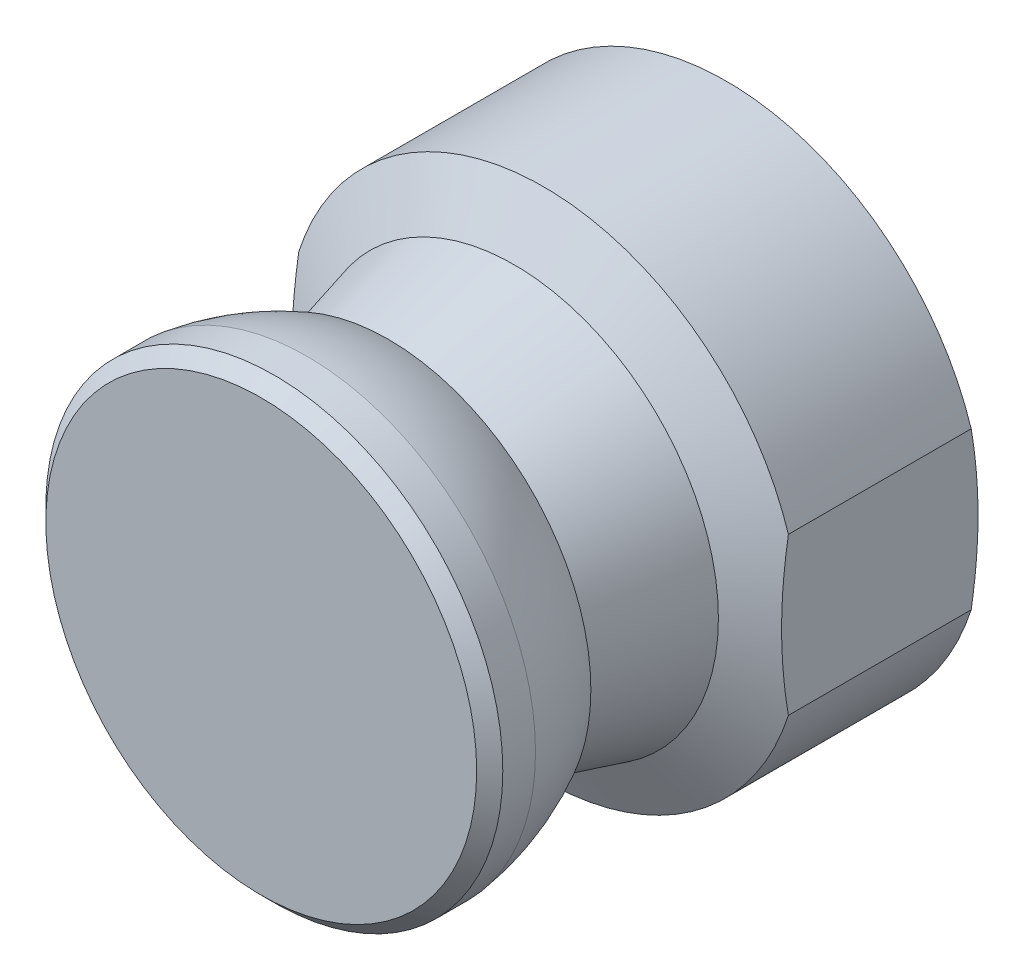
ISO-10303-21;
HEADER;
FILE_DESCRIPTION(('STEP AP214'),'2;1');
FILE_NAME('part.step','',(''),(''),'','','');
FILE_SCHEMA(('AUTOMOTIVE_DESIGN { 1 0 10303 214 1 1 1 1 }'));
ENDSEC;
DATA;
#1=APPLICATION_CONTEXT('core data for automotive mechanical design processes');
#2=APPLICATION_PROTOCOL_DEFINITION('international standard','automotive_design',2000,#1);
#3=PRODUCT_CONTEXT('',#1,'mechanical');
#4=PRODUCT('Part','Part','',(#3));
#5=PRODUCT_RELATED_PRODUCT_CATEGORY('part','',(#4));
#6=PRODUCT_DEFINITION_FORMATION('','',#4);
#7=PRODUCT_DEFINITION_CONTEXT('part definition',#1,'design');
#8=PRODUCT_DEFINITION('design','',#6,#7);
#9=PRODUCT_DEFINITION_SHAPE('','',#8);
#10=(LENGTH_UNIT() NAMED_UNIT(*) SI_UNIT(.MILLI.,.METRE.));
#11=(NAMED_UNIT(*) PLANE_ANGLE_UNIT() SI_UNIT($,.RADIAN.));
#12=(NAMED_UNIT(*) SI_UNIT($,.STERADIAN.) SOLID_ANGLE_UNIT());
#13=UNCERTAINTY_MEASURE_WITH_UNIT(LENGTH_MEASURE(1.E-05),#10,'distance_accuracy_value','');
#14=(GEOMETRIC_REPRESENTATION_CONTEXT(3) GLOBAL_UNCERTAINTY_ASSIGNED_CONTEXT((#13)) GLOBAL_UNIT_ASSIGNED_CONTEXT((#10,
#11,#12)) REPRESENTATION_CONTEXT('',''));
#15=CARTESIAN_POINT('',(0.,0.,0.));
#16=DIRECTION('',(0.,0.,1.));
#17=DIRECTION('',(1.,0.,0.));
#18=AXIS2_PLACEMENT_3D('',#15,#16,#17);
#19=CARTESIAN_POINT('',(0.,0.,29.));
#20=DIRECTION('',(0.,0.,1.));
#21=DIRECTION('',(1.,0.,0.));
#22=AXIS2_PLACEMENT_3D('',#19,#20,#21);
#23=CYLINDRICAL_SURFACE('',#22,15.75);
#24=DIRECTION('',(0.,0.,1.));
#25=VECTOR('',#24,1.);
#26=CARTESIAN_POINT('',(-15.,4.80234317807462,29.));
#27=LINE('',#26,#25);
#28=CARTESIAN_POINT('',(-15.,4.80234317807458,11.7));
#29=VERTEX_POINT('',#28);
#30=CARTESIAN_POINT('',(-15.,4.80234317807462,0.499999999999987));
#31=VERTEX_POINT('',#30);
#32=EDGE_CURVE('E60',#29,#31,#27,.F.);
#33=ORIENTED_EDGE('',*,*,#32,.F.);
#34=CARTESIAN_POINT('',(0.,0.,11.7));
#35=DIRECTION('',(0.,0.,1.));
#36=DIRECTION('',(1.,0.,0.));
#37=AXIS2_PLACEMENT_3D('',#34,#35,#36);
#38=CIRCLE('',#37,15.75);
#39=CARTESIAN_POINT('',(15.,4.80234317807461,11.7));
#40=VERTEX_POINT('',#39);
#41=EDGE_CURVE('E68',#40,#29,#38,.T.);
#42=ORIENTED_EDGE('',*,*,#41,.F.);
#43=DIRECTION('',(0.,0.,1.));
#44=VECTOR('',#43,1.);
#45=CARTESIAN_POINT('',(15.,4.80234317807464,29.));
#46=LINE('',#45,#44);
#47=CARTESIAN_POINT('',(15.,4.80234317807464,0.499999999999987));
#48=VERTEX_POINT('',#47);
#49=EDGE_CURVE('E42',#48,#40,#46,.T.);
#50=ORIENTED_EDGE('',*,*,#49,.F.);
#51=CARTESIAN_POINT('',(0.,0.,0.500000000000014));
#52=DIRECTION('',(0.,0.,1.));
#53=DIRECTION('',(1.,0.,0.));
#54=AXIS2_PLACEMENT_3D('',#51,#52,#53);
#55=CIRCLE('',#54,15.75);
#56=EDGE_CURVE('E70',#48,#31,#55,.T.);
#57=ORIENTED_EDGE('',*,*,#56,.T.);
#58=EDGE_LOOP('',(#33,#42,#50,#57));
#59=FACE_BOUND('',#58,.T.);
#60=ADVANCED_FACE('F14',(#59),#23,.T.);
#61=CARTESIAN_POINT('',(0.,0.,29.));
#62=DIRECTION('',(0.,0.,1.));
#63=DIRECTION('',(1.,0.,0.));
#64=AXIS2_PLACEMENT_3D('',#61,#62,#63);
#65=CYLINDRICAL_SURFACE('',#64,10.);
#66=CARTESIAN_POINT('',(0.,0.,13.5));
#67=DIRECTION('',(0.,0.,1.));
#68=DIRECTION('',(1.,0.,0.));
#69=AXIS2_PLACEMENT_3D('',#66,#67,#68);
#70=CIRCLE('',#69,10.);
#71=CARTESIAN_POINT('',(10.,0.,13.5));
#72=VERTEX_POINT('',#71);
#73=EDGE_CURVE('E148',#72,#72,#70,.T.);
#74=ORIENTED_EDGE('',*,*,#73,.T.);
#75=EDGE_LOOP('',(#74));
#76=FACE_BOUND('',#75,.T.);
#77=CARTESIAN_POINT('',(0.,0.,0.));
#78=DIRECTION('',(0.,0.,1.));
#79=DIRECTION('',(1.,0.,0.));
#80=AXIS2_PLACEMENT_3D('',#77,#78,#79);
#81=CIRCLE('',#80,10.);
#82=CARTESIAN_POINT('',(10.,0.,0.));
#83=VERTEX_POINT('',#82);
#84=EDGE_CURVE('E86',#83,#83,#81,.T.);
#85=ORIENTED_EDGE('',*,*,#84,.F.);
#86=EDGE_LOOP('',(#85));
#87=FACE_BOUND('',#86,.T.);
#88=ADVANCED_FACE('F16',(#76,#87),#65,.F.);
#89=CARTESIAN_POINT('',(10.,0.,0.));
#90=DIRECTION('',(0.,0.,-1.));
#91=DIRECTION('',(-1.,0.,0.));
#92=AXIS2_PLACEMENT_3D('',#89,#90,#91);
#93=PLANE('',#92);
#94=ORIENTED_EDGE('',*,*,#84,.T.);
#95=EDGE_LOOP('',(#94));
#96=FACE_BOUND('',#95,.T.);
#97=CARTESIAN_POINT('',(0.,0.,0.));
#98=DIRECTION('',(0.,0.,1.));
#99=DIRECTION('',(1.,0.,0.));
#100=AXIS2_PLACEMENT_3D('',#97,#98,#99);
#101=CIRCLE('',#100,14.85);
#102=CARTESIAN_POINT('',(14.85,0.,0.));
#103=VERTEX_POINT('',#102);
#104=EDGE_CURVE('E83',#103,#103,#101,.T.);
#105=ORIENTED_EDGE('',*,*,#104,.F.);
#106=EDGE_LOOP('',(#105));
#107=FACE_BOUND('',#106,.T.);
#108=ADVANCED_FACE('F110',(#96,#107),#93,.T.);
#109=CARTESIAN_POINT('',(0.,0.,0.500000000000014));
#110=DIRECTION('',(0.,0.,1.));
#111=DIRECTION('',(1.,0.,0.));
#112=AXIS2_PLACEMENT_3D('',#109,#110,#111);
#113=CONICAL_SURFACE('',#112,15.75,1.06369782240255);
#114=CARTESIAN_POINT('',(-15.,-17.649830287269,4.61823667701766));
#115=CARTESIAN_POINT('',(-15.,-17.3722406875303,4.50072848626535));
#116=CARTESIAN_POINT('',(-15.,-17.0942364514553,4.38420065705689));
#117=CARTESIAN_POINT('',(-15.,-16.537323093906,4.15331315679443));
#118=CARTESIAN_POINT('',(-15.,-16.2584139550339,4.03895352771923));
#119=CARTESIAN_POINT('',(-15.,-15.4200966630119,3.69939009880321));
#120=CARTESIAN_POINT('',(-15.,-14.8592329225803,3.47775883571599));
#121=CARTESIAN_POINT('',(-15.,-13.729824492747,3.04486958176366));
#122=CARTESIAN_POINT('',(-15.,-13.1612542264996,2.83367809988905));
#123=CARTESIAN_POINT('',(-15.,-12.0189847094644,2.42569928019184));
#124=CARTESIAN_POINT('',(-15.,-11.445285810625,2.22891096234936));
#125=CARTESIAN_POINT('',(-15.,-10.3011217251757,1.85594943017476));
#126=CARTESIAN_POINT('',(-15.,-9.73074660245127,1.67950163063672));
#127=CARTESIAN_POINT('',(-15.,-8.58385438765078,1.34750253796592));
#128=CARTESIAN_POINT('',(-15.,-8.00733691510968,1.19195254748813));
#129=CARTESIAN_POINT('',(-15.,-6.84925678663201,0.906454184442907));
#130=CARTESIAN_POINT('',(-15.,-6.26770765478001,0.776451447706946));
#131=CARTESIAN_POINT('',(-15.,-5.0987344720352,0.546373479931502));
#132=CARTESIAN_POINT('',(-15.,-4.51131171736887,0.44629179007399));
#133=CARTESIAN_POINT('',(-15.,-3.57558288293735,0.314797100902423));
#134=CARTESIAN_POINT('',(-15.,-3.22884186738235,0.272101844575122));
#135=CARTESIAN_POINT('',(-15.,-2.53404964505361,0.199287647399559));
#136=CARTESIAN_POINT('',(-15.,-2.18599852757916,0.169167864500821));
#137=CARTESIAN_POINT('',(-15.,-1.4889343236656,0.122080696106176));
#138=CARTESIAN_POINT('',(-15.,-1.1399210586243,0.105115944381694));
#139=CARTESIAN_POINT('',(-15.,-0.441493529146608,0.0846908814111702));
#140=CARTESIAN_POINT('',(-15.,-0.0920792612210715,0.0812306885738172));
#141=CARTESIAN_POINT('',(-15.,0.607727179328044,0.0878977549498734));
#142=CARTESIAN_POINT('',(-15.,0.958118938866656,0.0980681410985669));
#143=CARTESIAN_POINT('',(-15.,1.65824729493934,0.131861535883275));
#144=CARTESIAN_POINT('',(-15.,2.00798389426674,0.155484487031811));
#145=CARTESIAN_POINT('',(-15.,2.70621140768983,0.215701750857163));
#146=CARTESIAN_POINT('',(-15.,3.05470270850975,0.252291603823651));
#147=CARTESIAN_POINT('',(-15.,3.75019700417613,0.33776272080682));
#148=CARTESIAN_POINT('',(-15.,4.09719985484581,0.386645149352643));
#149=CARTESIAN_POINT('',(-15.,4.86808580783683,0.508283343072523));
#150=CARTESIAN_POINT('',(-15.,5.29151132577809,0.583940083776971));
#151=CARTESIAN_POINT('',(-15.,6.13531577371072,0.750798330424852));
#152=CARTESIAN_POINT('',(-15.,6.5556943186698,0.8420017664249));
#153=CARTESIAN_POINT('',(-15.,7.39342723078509,1.03822438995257));
#154=CARTESIAN_POINT('',(-15.,7.81077991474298,1.1432507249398));
#155=CARTESIAN_POINT('',(-15.,8.64223160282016,1.3653697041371));
#156=CARTESIAN_POINT('',(-15.,9.05633070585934,1.48246197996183));
#157=CARTESIAN_POINT('',(-15.,9.88316915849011,1.72766461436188));
#158=CARTESIAN_POINT('',(-15.,10.2958951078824,1.85581997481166));
#159=CARTESIAN_POINT('',(-15.,11.1183989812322,2.12129757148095));
#160=CARTESIAN_POINT('',(-15.,11.5281767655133,2.25862023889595));
#161=CARTESIAN_POINT('',(-15.,12.3448794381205,2.5411422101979));
#162=CARTESIAN_POINT('',(-15.,12.7518050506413,2.68633942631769));
#163=CARTESIAN_POINT('',(-15.,13.5631533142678,2.98357842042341));
#164=CARTESIAN_POINT('',(-15.,13.9675758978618,3.13562038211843));
#165=CARTESIAN_POINT('',(-15.,15.1805679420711,3.60179656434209));
#166=CARTESIAN_POINT('',(-15.,15.9857034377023,3.92487237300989));
#167=CARTESIAN_POINT('',(-15.,17.588583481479,4.58890618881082));
#168=CARTESIAN_POINT('',(-15.,18.3863274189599,4.92986565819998));
#169=CARTESIAN_POINT('',(-15.,19.574224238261,5.44973337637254));
#170=CARTESIAN_POINT('',(-15.,19.9666515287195,5.62347190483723));
#171=CARTESIAN_POINT('',(-15.,20.7501819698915,5.97391456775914));
#172=CARTESIAN_POINT('',(-15.,21.1412851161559,6.15061871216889));
#173=CARTESIAN_POINT('',(-15.,21.9221955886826,6.50659335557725));
#174=CARTESIAN_POINT('',(-15.,22.312003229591,6.6858631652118));
#175=CARTESIAN_POINT('',(-15.,23.0905351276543,7.04672538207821));
#176=CARTESIAN_POINT('',(-15.,23.4792594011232,7.22831775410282));
#177=CARTESIAN_POINT('',(-15.,23.8675022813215,7.41092945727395));
#178=B_SPLINE_CURVE_WITH_KNOTS('',3,(#114,#115,#116,#117,#118,#119,#120,#121,#122,#123,#124,
#125,#126,#127,#128,#129,#130,#131,#132,#133,#134,#135,#136,#137,#138,#139,#140,#141,#142,#143,
#144,#145,#146,#147,#148,#149,#150,#151,#152,#153,#154,#155,#156,#157,#158,#159,#160,#161,#162,
#163,#164,#165,#166,#167,#168,#169,#170,#171,#172,#173,#174,#175,#176,#177),.UNSPECIFIED.,.F.,
.F.,(4,2,2,2,2,2,2,2,2,2,2,2,2,2,2,2,2,2,2,2,2,2,2,2,2,2,2,2,2,2,2,4),(0.,0.904306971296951,
1.80863143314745,3.61771805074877,5.43714177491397,7.25644158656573,9.04724962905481,
10.8381692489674,12.6252355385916,14.4119157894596,15.4597969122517,16.5076078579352,
17.5556285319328,18.6036583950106,19.655012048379,20.706361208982,21.7573491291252,
22.8084366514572,24.0984943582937,25.3887123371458,26.6796000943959,27.9704484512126,
29.2668202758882,30.5632531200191,31.859343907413,33.1554695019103,35.7577579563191,
38.360259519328,39.6477502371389,40.9352452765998,42.2224006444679,43.5095365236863),.UNSPECIFIED.);
#179=CARTESIAN_POINT('',(-15.,-4.80234317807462,0.499999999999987));
#180=VERTEX_POINT('',#179);
#181=EDGE_CURVE('E71',#31,#180,#178,.F.);
#182=ORIENTED_EDGE('',*,*,#181,.F.);
#183=ORIENTED_EDGE('',*,*,#56,.F.);
#184=CARTESIAN_POINT('',(15.,-17.649830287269,4.61823667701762));
#185=CARTESIAN_POINT('',(15.,-17.3722406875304,4.5007284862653));
#186=CARTESIAN_POINT('',(15.,-17.0942364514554,4.38420065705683));
#187=CARTESIAN_POINT('',(15.,-16.537323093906,4.15331315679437));
#188=CARTESIAN_POINT('',(15.,-16.2584139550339,4.03895352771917));
#189=CARTESIAN_POINT('',(15.,-15.420096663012,3.69939009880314));
#190=CARTESIAN_POINT('',(15.,-14.8592329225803,3.47775883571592));
#191=CARTESIAN_POINT('',(15.,-13.729824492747,3.04486958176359));
#192=CARTESIAN_POINT('',(15.,-13.1612542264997,2.83367809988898));
#193=CARTESIAN_POINT('',(15.,-12.0189847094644,2.42569928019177));
#194=CARTESIAN_POINT('',(15.,-11.445285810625,2.22891096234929));
#195=CARTESIAN_POINT('',(15.,-10.3011217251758,1.85594943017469));
#196=CARTESIAN_POINT('',(15.,-9.7307466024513,1.67950163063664));
#197=CARTESIAN_POINT('',(15.,-8.5838543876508,1.34750253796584));
#198=CARTESIAN_POINT('',(15.,-8.0073369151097,1.19195254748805));
#199=CARTESIAN_POINT('',(15.,-6.84925678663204,0.906454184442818));
#200=CARTESIAN_POINT('',(15.,-6.26770765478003,0.776451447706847));
#201=CARTESIAN_POINT('',(15.,-5.09873447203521,0.546373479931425));
#202=CARTESIAN_POINT('',(15.,-4.51131171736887,0.446291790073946));
#203=CARTESIAN_POINT('',(15.,-3.57558288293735,0.31479710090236));
#204=CARTESIAN_POINT('',(15.,-3.22884186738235,0.272101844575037));
#205=CARTESIAN_POINT('',(15.,-2.53404964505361,0.199287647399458));
#206=CARTESIAN_POINT('',(15.,-2.18599852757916,0.169167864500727));
#207=CARTESIAN_POINT('',(15.,-1.48893432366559,0.122080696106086));
#208=CARTESIAN_POINT('',(15.,-1.13992105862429,0.105115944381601));
#209=CARTESIAN_POINT('',(15.,-0.441493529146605,0.084690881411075));
#210=CARTESIAN_POINT('',(15.,-0.0920792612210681,0.0812306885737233));
#211=CARTESIAN_POINT('',(15.,0.607727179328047,0.0878977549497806));
#212=CARTESIAN_POINT('',(15.,0.958118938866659,0.0980681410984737));
#213=CARTESIAN_POINT('',(15.,1.65824729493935,0.131861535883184));
#214=CARTESIAN_POINT('',(15.,2.00798389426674,0.155484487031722));
#215=CARTESIAN_POINT('',(15.,2.70621140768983,0.215701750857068));
#216=CARTESIAN_POINT('',(15.,3.05470270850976,0.252291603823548));
#217=CARTESIAN_POINT('',(15.,3.75019700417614,0.337762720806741));
#218=CARTESIAN_POINT('',(15.,4.09719985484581,0.386645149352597));
#219=CARTESIAN_POINT('',(15.,4.86808580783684,0.508283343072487));
#220=CARTESIAN_POINT('',(15.,5.29151132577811,0.583940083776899));
#221=CARTESIAN_POINT('',(15.,6.13531577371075,0.750798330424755));
#222=CARTESIAN_POINT('',(15.,6.55569431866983,0.842001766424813));
#223=CARTESIAN_POINT('',(15.,7.39342723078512,1.03822438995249));
#224=CARTESIAN_POINT('',(15.,7.81077991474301,1.14325072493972));
#225=CARTESIAN_POINT('',(15.,8.64223160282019,1.36536970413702));
#226=CARTESIAN_POINT('',(15.,9.05633070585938,1.48246197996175));
#227=CARTESIAN_POINT('',(15.,9.88316915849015,1.72766461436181));
#228=CARTESIAN_POINT('',(15.,10.2958951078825,1.85581997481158));
#229=CARTESIAN_POINT('',(15.,11.1183989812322,2.12129757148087));
#230=CARTESIAN_POINT('',(15.,11.5281767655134,2.25862023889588));
#231=CARTESIAN_POINT('',(15.,12.3448794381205,2.54114221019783));
#232=CARTESIAN_POINT('',(15.,12.7518050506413,2.68633942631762));
#233=CARTESIAN_POINT('',(15.,13.5631533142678,2.98357842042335));
#234=CARTESIAN_POINT('',(15.,13.9675758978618,3.13562038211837));
#235=CARTESIAN_POINT('',(15.,15.1805679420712,3.60179656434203));
#236=CARTESIAN_POINT('',(15.,15.9857034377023,3.92487237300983));
#237=CARTESIAN_POINT('',(15.,17.588583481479,4.58890618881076));
#238=CARTESIAN_POINT('',(15.,18.3863274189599,4.92986565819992));
#239=CARTESIAN_POINT('',(15.,19.574224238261,5.44973337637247));
#240=CARTESIAN_POINT('',(15.,19.9666515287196,5.62347190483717));
#241=CARTESIAN_POINT('',(15.,20.7501819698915,5.97391456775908));
#242=CARTESIAN_POINT('',(15.,21.1412851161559,6.15061871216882));
#243=CARTESIAN_POINT('',(15.,21.9221955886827,6.50659335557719));
#244=CARTESIAN_POINT('',(15.,22.3120032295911,6.68586316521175));
#245=CARTESIAN_POINT('',(15.,23.0905351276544,7.04672538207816));
#246=CARTESIAN_POINT('',(15.,23.4792594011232,7.22831775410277));
#247=CARTESIAN_POINT('',(15.,23.8675022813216,7.41092945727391));
#248=B_SPLINE_CURVE_WITH_KNOTS('',3,(#184,#185,#186,#187,#188,#189,#190,#191,#192,#193,#194,
#195,#196,#197,#198,#199,#200,#201,#202,#203,#204,#205,#206,#207,#208,#209,#210,#211,#212,#213,
#214,#215,#216,#217,#218,#219,#220,#221,#222,#223,#224,#225,#226,#227,#228,#229,#230,#231,#232,
#233,#234,#235,#236,#237,#238,#239,#240,#241,#242,#243,#244,#245,#246,#247),.UNSPECIFIED.,.F.,
.F.,(4,2,2,2,2,2,2,2,2,2,2,2,2,2,2,2,2,2,2,2,2,2,2,2,2,2,2,2,2,2,2,4),(0.,0.904306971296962,
1.80863143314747,3.6177180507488,5.437141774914,7.25644158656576,9.04724962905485,
10.8381692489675,12.6252355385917,14.4119157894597,15.4597969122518,16.5076078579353,
17.5556285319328,18.6036583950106,19.655012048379,20.706361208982,21.7573491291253,
22.8084366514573,24.0984943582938,25.3887123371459,26.679600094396,27.9704484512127,
29.2668202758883,30.5632531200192,31.8593439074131,33.1554695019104,35.7577579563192,
38.3602595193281,39.647750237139,40.9352452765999,42.222400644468,43.5095365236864),.UNSPECIFIED.);
#249=CARTESIAN_POINT('',(15.,-4.80234317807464,0.499999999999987));
#250=VERTEX_POINT('',#249);
#251=EDGE_CURVE('E114',#250,#48,#248,.T.);
#252=ORIENTED_EDGE('',*,*,#251,.F.);
#253=EDGE_CURVE('E75',#180,#250,#55,.T.);
#254=ORIENTED_EDGE('',*,*,#253,.F.);
#255=EDGE_LOOP('',(#182,#183,#252,#254));
#256=FACE_BOUND('',#255,.T.);
#257=ORIENTED_EDGE('',*,*,#104,.T.);
#258=EDGE_LOOP('',(#257));
#259=FACE_BOUND('',#258,.T.);
#260=ADVANCED_FACE('F106',(#256,#259),#113,.T.);
#261=DIRECTION('',(0.,0.,1.));
#262=VECTOR('',#261,1.);
#263=CARTESIAN_POINT('',(-15.,-4.80234317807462,29.));
#264=LINE('',#263,#262);
#265=CARTESIAN_POINT('',(-15.,-4.80234317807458,11.7));
#266=VERTEX_POINT('',#265);
#267=EDGE_CURVE('E34',#180,#266,#264,.T.);
#268=ORIENTED_EDGE('',*,*,#267,.F.);
#269=ORIENTED_EDGE('',*,*,#253,.T.);
#270=DIRECTION('',(0.,0.,1.));
#271=VECTOR('',#270,1.);
#272=CARTESIAN_POINT('',(15.,-4.80234317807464,29.));
#273=LINE('',#272,#271);
#274=CARTESIAN_POINT('',(15.,-4.80234317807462,11.7));
#275=VERTEX_POINT('',#274);
#276=EDGE_CURVE('E158',#275,#250,#273,.F.);
#277=ORIENTED_EDGE('',*,*,#276,.F.);
#278=EDGE_CURVE('E76',#266,#275,#38,.T.);
#279=ORIENTED_EDGE('',*,*,#278,.F.);
#280=EDGE_LOOP('',(#268,#269,#277,#279));
#281=FACE_BOUND('',#280,.T.);
#282=ADVANCED_FACE('F101',(#281),#23,.T.);
#283=CARTESIAN_POINT('',(0.,0.,13.5));
#284=DIRECTION('',(0.,0.,-1.));
#285=DIRECTION('',(-1.,0.,0.));
#286=AXIS2_PLACEMENT_3D('',#283,#284,#285);
#287=CONICAL_SURFACE('',#286,12.51,1.06369782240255);
#288=CARTESIAN_POINT('',(-15.,-21.9227838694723,5.69261586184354));
#289=CARTESIAN_POINT('',(-15.,-21.5973102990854,5.84184269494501));
#290=CARTESIAN_POINT('',(-15.,-21.2714382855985,5.99020002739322));
#291=CARTESIAN_POINT('',(-15.,-20.6188133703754,6.28497486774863));
#292=CARTESIAN_POINT('',(-15.,-20.292060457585,6.43139235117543));
#293=CARTESIAN_POINT('',(-15.,-19.3102479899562,6.86748089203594));
#294=CARTESIAN_POINT('',(-15.,-18.6537527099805,7.15393376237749));
#295=CARTESIAN_POINT('',(-15.,-17.3322168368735,7.71788826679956));
#296=CARTESIAN_POINT('',(-15.,-16.667148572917,7.9953252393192));
#297=CARTESIAN_POINT('',(-15.,-15.3315348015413,8.53663927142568));
#298=CARTESIAN_POINT('',(-15.,-14.6609895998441,8.8005170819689));
#299=CARTESIAN_POINT('',(-15.,-13.3107598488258,9.31209495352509));
#300=CARTESIAN_POINT('',(-15.,-12.6310500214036,9.55972867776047));
#301=CARTESIAN_POINT('',(-15.,-11.2638525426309,10.0329494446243));
#302=CARTESIAN_POINT('',(-15.,-10.5763640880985,10.2585341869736));
#303=CARTESIAN_POINT('',(-15.,-9.1942903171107,10.6810205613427));
#304=CARTESIAN_POINT('',(-15.,-8.4997250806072,10.8779872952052));
#305=CARTESIAN_POINT('',(-15.,-7.10150983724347,11.2363591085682));
#306=CARTESIAN_POINT('',(-15.,-6.39786274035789,11.3977752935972));
#307=CARTESIAN_POINT('',(-15.,-5.33412996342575,11.6073731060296));
#308=CARTESIAN_POINT('',(-15.,-4.97724425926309,11.6719420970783));
#309=CARTESIAN_POINT('',(-15.,-4.2614842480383,11.788974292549));
#310=CARTESIAN_POINT('',(-15.,-3.90260999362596,11.8414378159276));
#311=CARTESIAN_POINT('',(-15.,-3.1831477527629,11.9333158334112));
#312=CARTESIAN_POINT('',(-15.,-2.82255958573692,11.9727289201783));
#313=CARTESIAN_POINT('',(-15.,-2.10012835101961,12.0377164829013));
#314=CARTESIAN_POINT('',(-15.,-1.73828527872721,12.0632909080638));
#315=CARTESIAN_POINT('',(-15.,-1.01529083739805,12.0999843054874));
#316=CARTESIAN_POINT('',(-15.,-0.654142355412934,12.1111598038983));
#317=CARTESIAN_POINT('',(-15.,0.0683080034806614,12.11899603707));
#318=CARTESIAN_POINT('',(-15.,0.42960987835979,12.1156569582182));
#319=CARTESIAN_POINT('',(-15.,1.15170009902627,12.0945392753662));
#320=CARTESIAN_POINT('',(-15.,1.5124885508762,12.0767642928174));
#321=CARTESIAN_POINT('',(-15.,2.23310615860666,12.0271687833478));
#322=CARTESIAN_POINT('',(-15.,2.59293525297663,11.9953473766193));
#323=CARTESIAN_POINT('',(-15.,3.52620186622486,11.8952180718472));
#324=CARTESIAN_POINT('',(-15.,4.09853894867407,11.81647190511));
#325=CARTESIAN_POINT('',(-15.,5.23816928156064,11.6283463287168));
#326=CARTESIAN_POINT('',(-15.,5.80546150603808,11.5189608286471));
#327=CARTESIAN_POINT('',(-15.,6.93558639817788,11.2735557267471));
#328=CARTESIAN_POINT('',(-15.,7.4984055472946,11.1374744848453));
#329=CARTESIAN_POINT('',(-15.,8.61811284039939,10.8430880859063));
#330=CARTESIAN_POINT('',(-15.,9.17500128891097,10.6847840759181));
#331=CARTESIAN_POINT('',(-15.,10.2938723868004,10.3465346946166));
#332=CARTESIAN_POINT('',(-15.,10.8557458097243,10.1662305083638));
#333=CARTESIAN_POINT('',(-15.,11.9742303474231,9.78993063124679));
#334=CARTESIAN_POINT('',(-15.,12.5308410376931,9.5939336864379));
#335=CARTESIAN_POINT('',(-15.,13.6359857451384,9.19032965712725));
#336=CARTESIAN_POINT('',(-15.,14.1845482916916,8.98280039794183));
#337=CARTESIAN_POINT('',(-15.,15.0042471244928,8.66371469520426));
#338=CARTESIAN_POINT('',(-15.,15.2769165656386,8.55607034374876));
#339=CARTESIAN_POINT('',(-15.,15.821298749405,8.33840691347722));
#340=CARTESIAN_POINT('',(-15.,16.0930115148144,8.22838789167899));
#341=CARTESIAN_POINT('',(-15.,16.3642847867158,8.11729460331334));
#342=B_SPLINE_CURVE_WITH_KNOTS('',3,(#288,#289,#290,#291,#292,#293,#294,#295,#296,#297,#298,
#299,#300,#301,#302,#303,#304,#305,#306,#307,#308,#309,#310,#311,#312,#313,#314,#315,#316,#317,
#318,#319,#320,#321,#322,#323,#324,#325,#326,#327,#328,#329,#330,#331,#332,#333,#334,#335,#336,
#337,#338,#339,#340,#341),.UNSPECIFIED.,.F.,.F.,(4,2,2,2,2,2,2,2,2,2,2,2,2,2,2,2,2,2,2,2,2,2,2,
2,2,2,4),(0.,1.07415553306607,2.14832460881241,4.29705239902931,6.45878374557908,
8.62039523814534,10.7903456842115,12.960522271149,15.1256820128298,17.2901644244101,
18.3780309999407,19.4658689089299,20.5538240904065,21.6417832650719,22.7254582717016,
23.8091193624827,24.892508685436,25.9759658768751,27.7081390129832,29.4406567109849,
31.177222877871,32.9136994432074,34.6837015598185,36.4538452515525,38.2132276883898,
39.0926637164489,39.9720786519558),.UNSPECIFIED.);
#343=EDGE_CURVE('E9',#266,#29,#342,.T.);
#344=ORIENTED_EDGE('',*,*,#343,.F.);
#345=ORIENTED_EDGE('',*,*,#278,.T.);
#346=CARTESIAN_POINT('',(15.,-21.9227838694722,5.69261586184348));
#347=CARTESIAN_POINT('',(15.,-21.5973102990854,5.84184269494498));
#348=CARTESIAN_POINT('',(15.,-21.2714382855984,5.9902000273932));
#349=CARTESIAN_POINT('',(15.,-20.6188133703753,6.28497486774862));
#350=CARTESIAN_POINT('',(15.,-20.292060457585,6.43139235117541));
#351=CARTESIAN_POINT('',(15.,-19.3102479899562,6.86748089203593));
#352=CARTESIAN_POINT('',(15.,-18.6537527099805,7.15393376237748));
#353=CARTESIAN_POINT('',(15.,-17.3322168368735,7.71788826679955));
#354=CARTESIAN_POINT('',(15.,-16.667148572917,7.99532523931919));
#355=CARTESIAN_POINT('',(15.,-15.3315348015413,8.53663927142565));
#356=CARTESIAN_POINT('',(15.,-14.6609895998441,8.80051708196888));
#357=CARTESIAN_POINT('',(15.,-13.3107598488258,9.31209495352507));
#358=CARTESIAN_POINT('',(15.,-12.6310500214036,9.55972867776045));
#359=CARTESIAN_POINT('',(15.,-11.2638525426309,10.0329494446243));
#360=CARTESIAN_POINT('',(15.,-10.5763640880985,10.2585341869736));
#361=CARTESIAN_POINT('',(15.,-9.19429031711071,10.6810205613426));
#362=CARTESIAN_POINT('',(15.,-8.49972508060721,10.8779872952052));
#363=CARTESIAN_POINT('',(15.,-7.10150983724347,11.2363591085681));
#364=CARTESIAN_POINT('',(15.,-6.39786274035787,11.3977752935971));
#365=CARTESIAN_POINT('',(15.,-5.33412996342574,11.6073731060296));
#366=CARTESIAN_POINT('',(15.,-4.97724425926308,11.6719420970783));
#367=CARTESIAN_POINT('',(15.,-4.26148424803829,11.788974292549));
#368=CARTESIAN_POINT('',(15.,-3.90260999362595,11.8414378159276));
#369=CARTESIAN_POINT('',(15.,-3.18314775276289,11.9333158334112));
#370=CARTESIAN_POINT('',(15.,-2.82255958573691,11.9727289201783));
#371=CARTESIAN_POINT('',(15.,-2.10012835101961,12.0377164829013));
#372=CARTESIAN_POINT('',(15.,-1.7382852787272,12.0632909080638));
#373=CARTESIAN_POINT('',(15.,-1.01529083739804,12.0999843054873));
#374=CARTESIAN_POINT('',(15.,-0.654142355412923,12.1111598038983));
#375=CARTESIAN_POINT('',(15.,0.0683080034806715,12.11899603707));
#376=CARTESIAN_POINT('',(15.,0.429609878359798,12.1156569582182));
#377=CARTESIAN_POINT('',(15.,1.15170009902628,12.0945392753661));
#378=CARTESIAN_POINT('',(15.,1.5124885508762,12.0767642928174));
#379=CARTESIAN_POINT('',(15.,2.23310615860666,12.0271687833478));
#380=CARTESIAN_POINT('',(15.,2.59293525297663,11.9953473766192));
#381=CARTESIAN_POINT('',(15.,3.52620186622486,11.8952180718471));
#382=CARTESIAN_POINT('',(15.,4.09853894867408,11.81647190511));
#383=CARTESIAN_POINT('',(15.,5.23816928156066,11.6283463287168));
#384=CARTESIAN_POINT('',(15.,5.8054615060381,11.5189608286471));
#385=CARTESIAN_POINT('',(15.,6.93558639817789,11.2735557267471));
#386=CARTESIAN_POINT('',(15.,7.49840554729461,11.1374744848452));
#387=CARTESIAN_POINT('',(15.,8.61811284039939,10.8430880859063));
#388=CARTESIAN_POINT('',(15.,9.17500128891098,10.6847840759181));
#389=CARTESIAN_POINT('',(15.,10.2938723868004,10.3465346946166));
#390=CARTESIAN_POINT('',(15.,10.8557458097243,10.1662305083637));
#391=CARTESIAN_POINT('',(15.,11.9742303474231,9.78993063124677));
#392=CARTESIAN_POINT('',(15.,12.5308410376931,9.59393368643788));
#393=CARTESIAN_POINT('',(15.,13.6359857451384,9.19032965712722));
#394=CARTESIAN_POINT('',(15.,14.1845482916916,8.9828003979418));
#395=CARTESIAN_POINT('',(15.,15.0042471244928,8.66371469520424));
#396=CARTESIAN_POINT('',(15.,15.2769165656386,8.55607034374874));
#397=CARTESIAN_POINT('',(15.,15.821298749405,8.33840691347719));
#398=CARTESIAN_POINT('',(15.,16.0930115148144,8.22838789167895));
#399=CARTESIAN_POINT('',(15.,16.3642847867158,8.11729460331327));
#400=B_SPLINE_CURVE_WITH_KNOTS('',3,(#346,#347,#348,#349,#350,#351,#352,#353,#354,#355,#356,
#357,#358,#359,#360,#361,#362,#363,#364,#365,#366,#367,#368,#369,#370,#371,#372,#373,#374,#375,
#376,#377,#378,#379,#380,#381,#382,#383,#384,#385,#386,#387,#388,#389,#390,#391,#392,#393,#394,
#395,#396,#397,#398,#399),.UNSPECIFIED.,.F.,.F.,(4,2,2,2,2,2,2,2,2,2,2,2,2,2,2,2,2,2,2,2,2,2,2,
2,2,2,4),(0.,1.07415553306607,2.14832460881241,4.2970523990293,6.45878374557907,8.6203952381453,
10.7903456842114,12.960522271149,15.1256820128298,17.29016442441,18.3780309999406,
19.4658689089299,20.5538240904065,21.6417832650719,22.7254582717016,23.8091193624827,
24.892508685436,25.9759658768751,27.7081390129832,29.4406567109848,31.177222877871,
32.9136994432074,34.6837015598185,36.4538452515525,38.2132276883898,39.0926637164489,
39.9720786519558),.UNSPECIFIED.);
#401=EDGE_CURVE('E28',#40,#275,#400,.F.);
#402=ORIENTED_EDGE('',*,*,#401,.F.);
#403=ORIENTED_EDGE('',*,*,#41,.T.);
#404=EDGE_LOOP('',(#344,#345,#402,#403));
#405=FACE_BOUND('',#404,.T.);
#406=CARTESIAN_POINT('',(0.,0.,13.5));
#407=DIRECTION('',(0.,0.,1.));
#408=DIRECTION('',(1.,0.,0.));
#409=AXIS2_PLACEMENT_3D('',#406,#407,#408);
#410=CIRCLE('',#409,12.51);
#411=CARTESIAN_POINT('',(12.51,0.,13.5));
#412=VERTEX_POINT('',#411);
#413=EDGE_CURVE('E79',#412,#412,#410,.T.);
#414=ORIENTED_EDGE('',*,*,#413,.F.);
#415=EDGE_LOOP('',(#414));
#416=FACE_BOUND('',#415,.T.);
#417=ADVANCED_FACE('F73',(#405,#416),#287,.T.);
#418=CARTESIAN_POINT('',(0.,0.,20.7));
#419=DIRECTION('',(0.,0.,-1.));
#420=DIRECTION('',(-1.,0.,0.));
#421=AXIS2_PLACEMENT_3D('',#418,#419,#420);
#422=CONICAL_SURFACE('',#421,10.6,0.259305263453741);
#423=ORIENTED_EDGE('',*,*,#413,.T.);
#424=EDGE_LOOP('',(#423));
#425=FACE_BOUND('',#424,.T.);
#426=CARTESIAN_POINT('',(0.,0.,20.7));
#427=DIRECTION('',(0.,0.,1.));
#428=DIRECTION('',(1.,0.,0.));
#429=AXIS2_PLACEMENT_3D('',#426,#427,#428);
#430=CIRCLE('',#429,10.6);
#431=CARTESIAN_POINT('',(10.6,0.,20.7));
#432=VERTEX_POINT('',#431);
#433=EDGE_CURVE('E170',#432,#432,#430,.T.);
#434=ORIENTED_EDGE('',*,*,#433,.F.);
#435=EDGE_LOOP('',(#434));
#436=FACE_BOUND('',#435,.T.);
#437=ADVANCED_FACE('F100',(#425,#436),#422,.T.);
#438=CARTESIAN_POINT('',(0.,0.,21.2));
#439=DIRECTION('',(0.,0.,1.));
#440=DIRECTION('',(1.,0.,0.));
#441=AXIS2_PLACEMENT_3D('',#438,#439,#440);
#442=CONICAL_SURFACE('',#441,10.9,0.540419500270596);
#443=ORIENTED_EDGE('',*,*,#433,.T.);
#444=EDGE_LOOP('',(#443));
#445=FACE_BOUND('',#444,.T.);
#446=CARTESIAN_POINT('',(0.,0.,21.2));
#447=DIRECTION('',(0.,0.,1.));
#448=DIRECTION('',(1.,0.,0.));
#449=AXIS2_PLACEMENT_3D('',#446,#447,#448);
#450=CIRCLE('',#449,10.9);
#451=CARTESIAN_POINT('',(10.9,0.,21.2));
#452=VERTEX_POINT('',#451);
#453=EDGE_CURVE('E168',#452,#452,#450,.T.);
#454=ORIENTED_EDGE('',*,*,#453,.F.);
#455=EDGE_LOOP('',(#454));
#456=FACE_BOUND('',#455,.T.);
#457=ADVANCED_FACE('F179',(#445,#456),#442,.T.);
#458=CARTESIAN_POINT('',(10.9,0.,21.2));
#459=DIRECTION('',(0.,0.,-1.));
#460=DIRECTION('',(-1.,0.,0.));
#461=AXIS2_PLACEMENT_3D('',#458,#459,#460);
#462=PLANE('',#461);
#463=ORIENTED_EDGE('',*,*,#453,.T.);
#464=EDGE_LOOP('',(#463));
#465=FACE_BOUND('',#464,.T.);
#466=CARTESIAN_POINT('',(0.,0.,21.2));
#467=DIRECTION('',(0.,0.,1.));
#468=DIRECTION('',(1.,0.,0.));
#469=AXIS2_PLACEMENT_3D('',#466,#467,#468);
#470=CIRCLE('',#469,12.3959162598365);
#471=CARTESIAN_POINT('',(12.3959162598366,0.,21.2));
#472=VERTEX_POINT('',#471);
#473=EDGE_CURVE('E165',#472,#472,#470,.T.);
#474=ORIENTED_EDGE('',*,*,#473,.F.);
#475=EDGE_LOOP('',(#474));
#476=FACE_BOUND('',#475,.T.);
#477=ADVANCED_FACE('F183',(#465,#476),#462,.T.);
#478=CARTESIAN_POINT('',(0.,0.,28.0277995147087));
#479=DIRECTION('',(0.,0.,1.));
#480=DIRECTION('',(1.,0.,0.));
#481=AXIS2_PLACEMENT_3D('',#478,#479,#480);
#482=DEGENERATE_TOROIDAL_SURFACE('',#481,0.28750000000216,14.4044400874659,.F.);
#483=ORIENTED_EDGE('',*,*,#473,.T.);
#484=EDGE_LOOP('',(#483));
#485=FACE_BOUND('',#484,.T.);
#486=CARTESIAN_POINT('',(0.,0.,26.1960686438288));
#487=DIRECTION('',(0.,0.,1.));
#488=DIRECTION('',(1.,0.,0.));
#489=AXIS2_PLACEMENT_3D('',#486,#487,#488);
#490=CIRCLE('',#489,14.);
#491=CARTESIAN_POINT('',(14.0000000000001,0.,26.1960686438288));
#492=VERTEX_POINT('',#491);
#493=EDGE_CURVE('E162',#492,#492,#490,.T.);
#494=ORIENTED_EDGE('',*,*,#493,.F.);
#495=EDGE_LOOP('',(#494));
#496=FACE_BOUND('',#495,.T.);
#497=ADVANCED_FACE('F187',(#485,#496),#482,.F.);
#498=CARTESIAN_POINT('',(0.,0.,29.));
#499=DIRECTION('',(0.,0.,1.));
#500=DIRECTION('',(1.,0.,0.));
#501=AXIS2_PLACEMENT_3D('',#498,#499,#500);
#502=CYLINDRICAL_SURFACE('',#501,14.);
#503=ORIENTED_EDGE('',*,*,#493,.T.);
#504=EDGE_LOOP('',(#503));
#505=FACE_BOUND('',#504,.T.);
#506=CARTESIAN_POINT('',(0.,0.,28.2));
#507=DIRECTION('',(0.,0.,1.));
#508=DIRECTION('',(1.,0.,0.));
#509=AXIS2_PLACEMENT_3D('',#506,#507,#508);
#510=CIRCLE('',#509,14.);
#511=CARTESIAN_POINT('',(14.0000000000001,0.,28.2));
#512=VERTEX_POINT('',#511);
#513=EDGE_CURVE('E156',#512,#512,#510,.T.);
#514=ORIENTED_EDGE('',*,*,#513,.F.);
#515=EDGE_LOOP('',(#514));
#516=FACE_BOUND('',#515,.T.);
#517=ADVANCED_FACE('F194',(#505,#516),#502,.T.);
#518=CARTESIAN_POINT('',(0.,0.,29.));
#519=DIRECTION('',(0.,0.,-1.));
#520=DIRECTION('',(-1.,0.,0.));
#521=AXIS2_PLACEMENT_3D('',#518,#519,#520);
#522=CONICAL_SURFACE('',#521,13.2,0.785398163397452);
#523=ORIENTED_EDGE('',*,*,#513,.T.);
#524=EDGE_LOOP('',(#523));
#525=FACE_BOUND('',#524,.T.);
#526=CARTESIAN_POINT('',(0.,0.,29.));
#527=DIRECTION('',(0.,0.,1.));
#528=DIRECTION('',(1.,0.,0.));
#529=AXIS2_PLACEMENT_3D('',#526,#527,#528);
#530=CIRCLE('',#529,13.2);
#531=CARTESIAN_POINT('',(13.2000000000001,0.,29.));
#532=VERTEX_POINT('',#531);
#533=EDGE_CURVE('E154',#532,#532,#530,.T.);
#534=ORIENTED_EDGE('',*,*,#533,.F.);
#535=EDGE_LOOP('',(#534));
#536=FACE_BOUND('',#535,.T.);
#537=ADVANCED_FACE('F198',(#525,#536),#522,.T.);
#538=CARTESIAN_POINT('',(0.,0.,29.));
#539=DIRECTION('',(0.,0.,1.));
#540=DIRECTION('',(1.,0.,0.));
#541=AXIS2_PLACEMENT_3D('',#538,#539,#540);
#542=PLANE('',#541);
#543=ORIENTED_EDGE('',*,*,#533,.T.);
#544=EDGE_LOOP('',(#543));
#545=FACE_BOUND('',#544,.T.);
#546=ADVANCED_FACE('F202',(#545),#542,.T.);
#547=CARTESIAN_POINT('',(0.,0.,13.5));
#548=DIRECTION('',(0.,0.,-1.));
#549=DIRECTION('',(-1.,0.,0.));
#550=AXIS2_PLACEMENT_3D('',#547,#548,#549);
#551=PLANE('',#550);
#552=ORIENTED_EDGE('',*,*,#73,.F.);
#553=EDGE_LOOP('',(#552));
#554=FACE_BOUND('',#553,.T.);
#555=ADVANCED_FACE('F135',(#554),#551,.T.);
#556=CARTESIAN_POINT('',(15.,18.6228739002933,20.));
#557=DIRECTION('',(-1.,0.,0.));
#558=DIRECTION('',(0.,0.,1.));
#559=AXIS2_PLACEMENT_3D('',#556,#557,#558);
#560=PLANE('',#559);
#561=ORIENTED_EDGE('',*,*,#251,.T.);
#562=ORIENTED_EDGE('',*,*,#49,.T.);
#563=ORIENTED_EDGE('',*,*,#401,.T.);
#564=ORIENTED_EDGE('',*,*,#276,.T.);
#565=EDGE_LOOP('',(#561,#562,#563,#564));
#566=FACE_BOUND('',#565,.T.);
#567=ADVANCED_FACE('F93',(#566),#560,.F.);
#568=CARTESIAN_POINT('',(-15.,18.6228739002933,20.));
#569=DIRECTION('',(1.,0.,0.));
#570=DIRECTION('',(0.,0.,-1.));
#571=AXIS2_PLACEMENT_3D('',#568,#569,#570);
#572=PLANE('',#571);
#573=ORIENTED_EDGE('',*,*,#181,.T.);
#574=ORIENTED_EDGE('',*,*,#267,.T.);
#575=ORIENTED_EDGE('',*,*,#343,.T.);
#576=ORIENTED_EDGE('',*,*,#32,.T.);
#577=EDGE_LOOP('',(#573,#574,#575,#576));
#578=FACE_BOUND('',#577,.T.);
#579=ADVANCED_FACE('F59',(#578),#572,.F.);
#580=CLOSED_SHELL('',(#60,#88,#108,#260,#282,#417,#437,#457,#477,#497,#517,#537,#546,#555,#567,#579));
#581=MANIFOLD_SOLID_BREP('B1',#580);
#582=ADVANCED_BREP_SHAPE_REPRESENTATION('',(#18,#581),#14);
#583=SHAPE_DEFINITION_REPRESENTATION(#9,#582);
ENDSEC;
END-ISO-10303-21;
